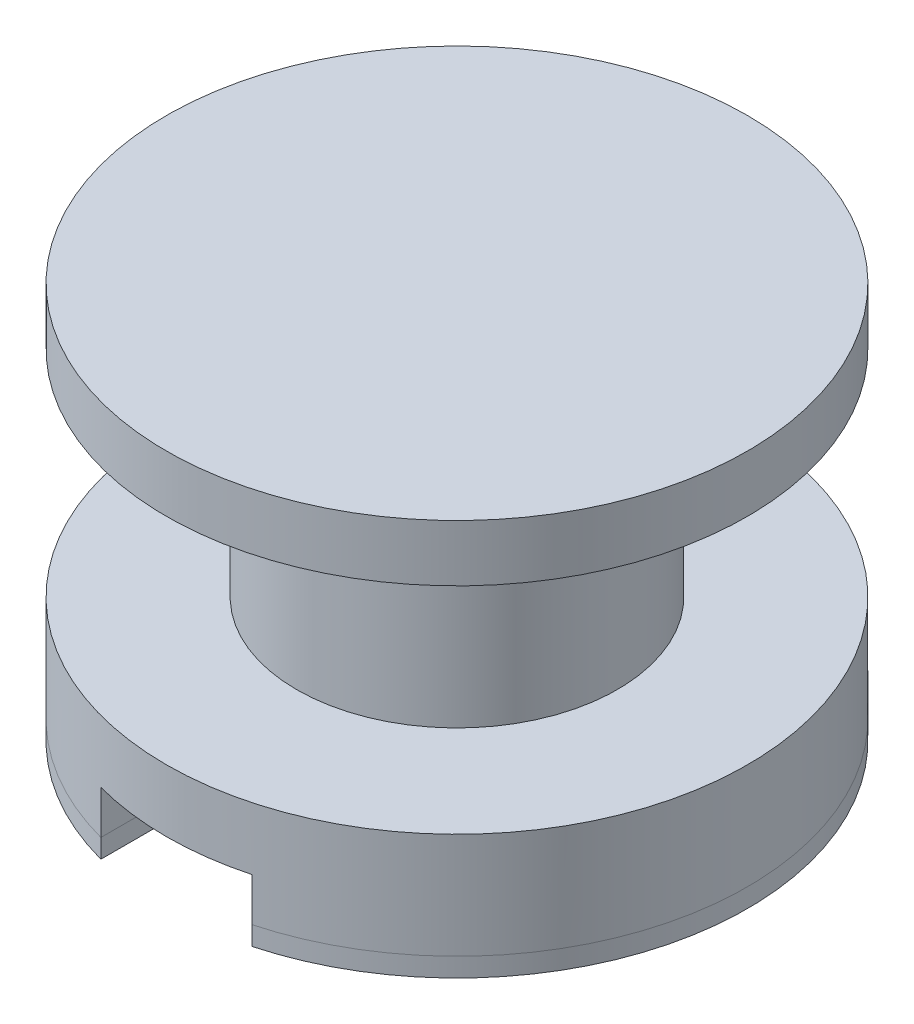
ISO-10303-21;
HEADER;
FILE_DESCRIPTION(('STEP AP214'),'2;1');
FILE_NAME('part.step','',(''),(''),'','','');
FILE_SCHEMA(('AUTOMOTIVE_DESIGN { 1 0 10303 214 1 1 1 1 }'));
ENDSEC;
DATA;
#1=APPLICATION_CONTEXT('core data for automotive mechanical design processes');
#2=APPLICATION_PROTOCOL_DEFINITION('international standard','automotive_design',2000,#1);
#3=PRODUCT_CONTEXT('',#1,'mechanical');
#4=PRODUCT('Part','Part','',(#3));
#5=PRODUCT_RELATED_PRODUCT_CATEGORY('part','',(#4));
#6=PRODUCT_DEFINITION_FORMATION('','',#4);
#7=PRODUCT_DEFINITION_CONTEXT('part definition',#1,'design');
#8=PRODUCT_DEFINITION('design','',#6,#7);
#9=PRODUCT_DEFINITION_SHAPE('','',#8);
#10=(LENGTH_UNIT() NAMED_UNIT(*) SI_UNIT(.MILLI.,.METRE.));
#11=(NAMED_UNIT(*) PLANE_ANGLE_UNIT() SI_UNIT($,.RADIAN.));
#12=(NAMED_UNIT(*) SI_UNIT($,.STERADIAN.) SOLID_ANGLE_UNIT());
#13=UNCERTAINTY_MEASURE_WITH_UNIT(LENGTH_MEASURE(1.E-05),#10,'distance_accuracy_value','');
#14=(GEOMETRIC_REPRESENTATION_CONTEXT(3) GLOBAL_UNCERTAINTY_ASSIGNED_CONTEXT((#13)) GLOBAL_UNIT_ASSIGNED_CONTEXT((#10,
#11,#12)) REPRESENTATION_CONTEXT('',''));
#15=CARTESIAN_POINT('',(0.,0.,0.));
#16=DIRECTION('',(0.,0.,1.));
#17=DIRECTION('',(1.,0.,0.));
#18=AXIS2_PLACEMENT_3D('',#15,#16,#17);
#19=CARTESIAN_POINT('',(0.,0.,0.));
#20=DIRECTION('',(0.,1.,0.));
#21=DIRECTION('',(0.,0.,1.));
#22=AXIS2_PLACEMENT_3D('',#19,#20,#21);
#23=CYLINDRICAL_SURFACE('',#22,3.9116);
#24=CARTESIAN_POINT('',(0.,0.254,0.));
#25=DIRECTION('',(0.,-1.,0.));
#26=DIRECTION('',(0.,0.,-1.));
#27=AXIS2_PLACEMENT_3D('',#24,#25,#26);
#28=CIRCLE('',#27,3.9116);
#29=CARTESIAN_POINT('',(1.016,0.254,-3.77734808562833));
#30=VERTEX_POINT('',#29);
#31=CARTESIAN_POINT('',(1.016,0.254,3.77734808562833));
#32=VERTEX_POINT('',#31);
#33=EDGE_CURVE('E76',#30,#32,#28,.T.);
#34=ORIENTED_EDGE('',*,*,#33,.T.);
#35=DIRECTION('',(0.,1.,0.));
#36=VECTOR('',#35,1.);
#37=CARTESIAN_POINT('',(1.016,0.,3.77734808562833));
#38=LINE('',#37,#36);
#39=CARTESIAN_POINT('',(1.016,0.,3.77734808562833));
#40=VERTEX_POINT('',#39);
#41=EDGE_CURVE('E12',#40,#32,#38,.T.);
#42=ORIENTED_EDGE('',*,*,#41,.F.);
#43=CARTESIAN_POINT('',(0.,0.,0.));
#44=DIRECTION('',(0.,-1.,0.));
#45=DIRECTION('',(0.,0.,-1.));
#46=AXIS2_PLACEMENT_3D('',#43,#44,#45);
#47=CIRCLE('',#46,3.9116);
#48=CARTESIAN_POINT('',(1.016,0.,-3.77734808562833));
#49=VERTEX_POINT('',#48);
#50=EDGE_CURVE('E75',#49,#40,#47,.T.);
#51=ORIENTED_EDGE('',*,*,#50,.F.);
#52=DIRECTION('',(0.,1.,0.));
#53=VECTOR('',#52,1.);
#54=CARTESIAN_POINT('',(1.016,0.,-3.77734808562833));
#55=LINE('',#54,#53);
#56=EDGE_CURVE('E53',#49,#30,#55,.T.);
#57=ORIENTED_EDGE('',*,*,#56,.T.);
#58=EDGE_LOOP('',(#34,#42,#51,#57));
#59=FACE_BOUND('',#58,.T.);
#60=ADVANCED_FACE('F45',(#59),#23,.T.);
#61=CARTESIAN_POINT('',(1.016,0.,3.77734808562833));
#62=DIRECTION('',(1.,0.,0.));
#63=DIRECTION('',(0.,0.,-1.));
#64=AXIS2_PLACEMENT_3D('',#61,#62,#63);
#65=PLANE('',#64);
#66=DIRECTION('',(0.,0.,-1.));
#67=VECTOR('',#66,1.);
#68=CARTESIAN_POINT('',(1.016,0.254,3.77734808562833));
#69=LINE('',#68,#67);
#70=EDGE_CURVE('E68',#32,#30,#69,.T.);
#71=ORIENTED_EDGE('',*,*,#70,.T.);
#72=ORIENTED_EDGE('',*,*,#56,.F.);
#73=DIRECTION('',(0.,0.,-1.));
#74=VECTOR('',#73,1.);
#75=CARTESIAN_POINT('',(1.016,0.,3.77734808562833));
#76=LINE('',#75,#74);
#77=EDGE_CURVE('E60',#40,#49,#76,.T.);
#78=ORIENTED_EDGE('',*,*,#77,.F.);
#79=ORIENTED_EDGE('',*,*,#41,.T.);
#80=EDGE_LOOP('',(#71,#72,#78,#79));
#81=FACE_BOUND('',#80,.T.);
#82=ADVANCED_FACE('F71',(#81),#65,.F.);
#83=CARTESIAN_POINT('',(0.,0.,0.));
#84=DIRECTION('',(0.,-1.,0.));
#85=DIRECTION('',(0.,0.,-1.));
#86=AXIS2_PLACEMENT_3D('',#83,#84,#85);
#87=PLANE('',#86);
#88=ORIENTED_EDGE('',*,*,#50,.T.);
#89=ORIENTED_EDGE('',*,*,#77,.T.);
#90=EDGE_LOOP('',(#88,#89));
#91=FACE_BOUND('',#90,.T.);
#92=ADVANCED_FACE('F83',(#91),#87,.T.);
#93=CARTESIAN_POINT('',(0.,0.254,0.));
#94=DIRECTION('',(0.,-1.,0.));
#95=DIRECTION('',(0.,0.,-1.));
#96=AXIS2_PLACEMENT_3D('',#93,#94,#95);
#97=PLANE('',#96);
#98=ORIENTED_EDGE('',*,*,#33,.F.);
#99=ORIENTED_EDGE('',*,*,#70,.F.);
#100=EDGE_LOOP('',(#98,#99));
#101=FACE_BOUND('',#100,.T.);
#102=ADVANCED_FACE('F79',(#101),#97,.F.);
#103=CLOSED_SHELL('',(#60,#82,#92,#102));
#104=MANIFOLD_SOLID_BREP('B2',#103);
#105=CARTESIAN_POINT('',(0.,0.,0.));
#106=DIRECTION('',(0.,1.,0.));
#107=DIRECTION('',(0.,0.,1.));
#108=AXIS2_PLACEMENT_3D('',#105,#106,#107);
#109=CYLINDRICAL_SURFACE('',#108,3.9116);
#110=CARTESIAN_POINT('',(0.,0.254,0.));
#111=DIRECTION('',(0.,-1.,0.));
#112=DIRECTION('',(0.,0.,-1.));
#113=AXIS2_PLACEMENT_3D('',#110,#111,#112);
#114=CIRCLE('',#113,3.9116);
#115=CARTESIAN_POINT('',(-1.016,0.254,3.77734808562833));
#116=VERTEX_POINT('',#115);
#117=CARTESIAN_POINT('',(-1.016,0.254,-3.77734808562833));
#118=VERTEX_POINT('',#117);
#119=EDGE_CURVE('E156',#116,#118,#114,.T.);
#120=ORIENTED_EDGE('',*,*,#119,.T.);
#121=DIRECTION('',(0.,1.,0.));
#122=VECTOR('',#121,1.);
#123=CARTESIAN_POINT('',(-1.016,0.,-3.77734808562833));
#124=LINE('',#123,#122);
#125=CARTESIAN_POINT('',(-1.016,0.,-3.77734808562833));
#126=VERTEX_POINT('',#125);
#127=EDGE_CURVE('E43',#126,#118,#124,.T.);
#128=ORIENTED_EDGE('',*,*,#127,.F.);
#129=CARTESIAN_POINT('',(0.,0.,0.));
#130=DIRECTION('',(0.,-1.,0.));
#131=DIRECTION('',(0.,0.,-1.));
#132=AXIS2_PLACEMENT_3D('',#129,#130,#131);
#133=CIRCLE('',#132,3.9116);
#134=CARTESIAN_POINT('',(-1.016,0.,3.77734808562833));
#135=VERTEX_POINT('',#134);
#136=EDGE_CURVE('E155',#135,#126,#133,.T.);
#137=ORIENTED_EDGE('',*,*,#136,.F.);
#138=DIRECTION('',(0.,1.,0.));
#139=VECTOR('',#138,1.);
#140=CARTESIAN_POINT('',(-1.016,0.,3.77734808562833));
#141=LINE('',#140,#139);
#142=EDGE_CURVE('E133',#135,#116,#141,.T.);
#143=ORIENTED_EDGE('',*,*,#142,.T.);
#144=EDGE_LOOP('',(#120,#128,#137,#143));
#145=FACE_BOUND('',#144,.T.);
#146=ADVANCED_FACE('F125',(#145),#109,.T.);
#147=CARTESIAN_POINT('',(-1.016,0.,3.77734808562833));
#148=DIRECTION('',(-1.,0.,0.));
#149=DIRECTION('',(0.,0.,1.));
#150=AXIS2_PLACEMENT_3D('',#147,#148,#149);
#151=PLANE('',#150);
#152=DIRECTION('',(0.,0.,1.));
#153=VECTOR('',#152,1.);
#154=CARTESIAN_POINT('',(-1.016,0.254,3.77734808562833));
#155=LINE('',#154,#153);
#156=EDGE_CURVE('E148',#118,#116,#155,.T.);
#157=ORIENTED_EDGE('',*,*,#156,.T.);
#158=ORIENTED_EDGE('',*,*,#142,.F.);
#159=DIRECTION('',(0.,0.,1.));
#160=VECTOR('',#159,1.);
#161=CARTESIAN_POINT('',(-1.016,0.,3.77734808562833));
#162=LINE('',#161,#160);
#163=EDGE_CURVE('E140',#126,#135,#162,.T.);
#164=ORIENTED_EDGE('',*,*,#163,.F.);
#165=ORIENTED_EDGE('',*,*,#127,.T.);
#166=EDGE_LOOP('',(#157,#158,#164,#165));
#167=FACE_BOUND('',#166,.T.);
#168=ADVANCED_FACE('F151',(#167),#151,.F.);
#169=CARTESIAN_POINT('',(0.,0.,0.));
#170=DIRECTION('',(0.,-1.,0.));
#171=DIRECTION('',(0.,0.,-1.));
#172=AXIS2_PLACEMENT_3D('',#169,#170,#171);
#173=PLANE('',#172);
#174=ORIENTED_EDGE('',*,*,#136,.T.);
#175=ORIENTED_EDGE('',*,*,#163,.T.);
#176=EDGE_LOOP('',(#174,#175));
#177=FACE_BOUND('',#176,.T.);
#178=ADVANCED_FACE('F163',(#177),#173,.T.);
#179=CARTESIAN_POINT('',(0.,0.254,0.));
#180=DIRECTION('',(0.,-1.,0.));
#181=DIRECTION('',(0.,0.,-1.));
#182=AXIS2_PLACEMENT_3D('',#179,#180,#181);
#183=PLANE('',#182);
#184=ORIENTED_EDGE('',*,*,#119,.F.);
#185=ORIENTED_EDGE('',*,*,#156,.F.);
#186=EDGE_LOOP('',(#184,#185));
#187=FACE_BOUND('',#186,.T.);
#188=ADVANCED_FACE('F159',(#187),#183,.F.);
#189=CLOSED_SHELL('',(#146,#168,#178,#188));
#190=MANIFOLD_SOLID_BREP('B6',#189);
#191=CARTESIAN_POINT('',(0.,1.6764,0.));
#192=DIRECTION('',(0.,-1.,0.));
#193=DIRECTION('',(0.,0.,-1.));
#194=AXIS2_PLACEMENT_3D('',#191,#192,#193);
#195=CYLINDRICAL_SURFACE('',#194,3.9116);
#196=CARTESIAN_POINT('',(0.,1.6764,0.));
#197=DIRECTION('',(0.,1.,0.));
#198=DIRECTION('',(0.,0.,1.));
#199=AXIS2_PLACEMENT_3D('',#196,#197,#198);
#200=CIRCLE('',#199,3.9116);
#201=CARTESIAN_POINT('',(0.,1.6764,3.9116));
#202=VERTEX_POINT('',#201);
#203=EDGE_CURVE('E252',#202,#202,#200,.T.);
#204=ORIENTED_EDGE('',*,*,#203,.F.);
#205=EDGE_LOOP('',(#204));
#206=FACE_BOUND('',#205,.T.);
#207=CARTESIAN_POINT('',(0.,0.254,0.));
#208=DIRECTION('',(0.,-1.,0.));
#209=DIRECTION('',(0.,0.,-1.));
#210=AXIS2_PLACEMENT_3D('',#207,#208,#209);
#211=CIRCLE('',#210,3.9116);
#212=CARTESIAN_POINT('',(1.016,0.254,-3.77734808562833));
#213=VERTEX_POINT('',#212);
#214=CARTESIAN_POINT('',(1.016,0.254,3.77734808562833));
#215=VERTEX_POINT('',#214);
#216=EDGE_CURVE('E209',#213,#215,#211,.T.);
#217=ORIENTED_EDGE('',*,*,#216,.F.);
#218=DIRECTION('',(0.,-1.,0.));
#219=VECTOR('',#218,1.);
#220=CARTESIAN_POINT('',(1.016,1.6764,-3.77734808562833));
#221=LINE('',#220,#219);
#222=CARTESIAN_POINT('',(1.016,0.8382,-3.77734808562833));
#223=VERTEX_POINT('',#222);
#224=EDGE_CURVE('E242',#213,#223,#221,.F.);
#225=ORIENTED_EDGE('',*,*,#224,.T.);
#226=CARTESIAN_POINT('',(0.,0.8382,0.));
#227=DIRECTION('',(0.,1.,0.));
#228=DIRECTION('',(0.,0.,1.));
#229=AXIS2_PLACEMENT_3D('',#226,#227,#228);
#230=CIRCLE('',#229,3.9116);
#231=CARTESIAN_POINT('',(-1.016,0.8382,-3.77734808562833));
#232=VERTEX_POINT('',#231);
#233=EDGE_CURVE('E261',#223,#232,#230,.T.);
#234=ORIENTED_EDGE('',*,*,#233,.T.);
#235=DIRECTION('',(0.,-1.,0.));
#236=VECTOR('',#235,1.);
#237=CARTESIAN_POINT('',(-1.016,1.6764,-3.77734808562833));
#238=LINE('',#237,#236);
#239=CARTESIAN_POINT('',(-1.016,0.254,-3.77734808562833));
#240=VERTEX_POINT('',#239);
#241=EDGE_CURVE('E250',#232,#240,#238,.T.);
#242=ORIENTED_EDGE('',*,*,#241,.T.);
#243=CARTESIAN_POINT('',(-1.016,0.254,3.77734808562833));
#244=VERTEX_POINT('',#243);
#245=EDGE_CURVE('E215',#244,#240,#211,.T.);
#246=ORIENTED_EDGE('',*,*,#245,.F.);
#247=DIRECTION('',(0.,-1.,0.));
#248=VECTOR('',#247,1.);
#249=CARTESIAN_POINT('',(-1.016,1.6764,3.77734808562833));
#250=LINE('',#249,#248);
#251=CARTESIAN_POINT('',(-1.016,0.8382,3.77734808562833));
#252=VERTEX_POINT('',#251);
#253=EDGE_CURVE('E255',#244,#252,#250,.F.);
#254=ORIENTED_EDGE('',*,*,#253,.T.);
#255=CARTESIAN_POINT('',(1.016,0.8382,3.77734808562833));
#256=VERTEX_POINT('',#255);
#257=EDGE_CURVE('E260',#252,#256,#230,.T.);
#258=ORIENTED_EDGE('',*,*,#257,.T.);
#259=DIRECTION('',(0.,-1.,0.));
#260=VECTOR('',#259,1.);
#261=CARTESIAN_POINT('',(1.016,1.6764,3.77734808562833));
#262=LINE('',#261,#260);
#263=EDGE_CURVE('E244',#256,#215,#262,.T.);
#264=ORIENTED_EDGE('',*,*,#263,.T.);
#265=EDGE_LOOP('',(#217,#225,#234,#242,#246,#254,#258,#264));
#266=FACE_BOUND('',#265,.T.);
#267=ADVANCED_FACE('F196',(#206,#266),#195,.T.);
#268=CARTESIAN_POINT('',(1.016,0.8382,-3.9116));
#269=DIRECTION('',(1.,0.,0.));
#270=DIRECTION('',(0.,0.,-1.));
#271=AXIS2_PLACEMENT_3D('',#268,#269,#270);
#272=PLANE('',#271);
#273=DIRECTION('',(0.,0.,-1.));
#274=VECTOR('',#273,1.);
#275=CARTESIAN_POINT('',(1.016,0.254,-3.9116));
#276=LINE('',#275,#274);
#277=EDGE_CURVE('E232',#215,#213,#276,.T.);
#278=ORIENTED_EDGE('',*,*,#277,.F.);
#279=ORIENTED_EDGE('',*,*,#263,.F.);
#280=DIRECTION('',(0.,0.,1.));
#281=VECTOR('',#280,1.);
#282=CARTESIAN_POINT('',(1.016,0.8382,-3.9116));
#283=LINE('',#282,#281);
#284=EDGE_CURVE('E249',#223,#256,#283,.T.);
#285=ORIENTED_EDGE('',*,*,#284,.F.);
#286=ORIENTED_EDGE('',*,*,#224,.F.);
#287=EDGE_LOOP('',(#278,#279,#285,#286));
#288=FACE_BOUND('',#287,.T.);
#289=ADVANCED_FACE('F247',(#288),#272,.F.);
#290=CARTESIAN_POINT('',(-1.016,0.8382,-3.9116));
#291=DIRECTION('',(-1.,0.,0.));
#292=DIRECTION('',(0.,0.,1.));
#293=AXIS2_PLACEMENT_3D('',#290,#291,#292);
#294=PLANE('',#293);
#295=DIRECTION('',(0.,0.,1.));
#296=VECTOR('',#295,1.);
#297=CARTESIAN_POINT('',(-1.016,0.254,-3.9116));
#298=LINE('',#297,#296);
#299=EDGE_CURVE('E123',#240,#244,#298,.T.);
#300=ORIENTED_EDGE('',*,*,#299,.F.);
#301=ORIENTED_EDGE('',*,*,#241,.F.);
#302=DIRECTION('',(0.,0.,-1.));
#303=VECTOR('',#302,1.);
#304=CARTESIAN_POINT('',(-1.016,0.8382,-3.9116));
#305=LINE('',#304,#303);
#306=EDGE_CURVE('E272',#252,#232,#305,.T.);
#307=ORIENTED_EDGE('',*,*,#306,.F.);
#308=ORIENTED_EDGE('',*,*,#253,.F.);
#309=EDGE_LOOP('',(#300,#301,#307,#308));
#310=FACE_BOUND('',#309,.T.);
#311=ADVANCED_FACE('F279',(#310),#294,.F.);
#312=CARTESIAN_POINT('',(0.,1.6764,0.));
#313=DIRECTION('',(0.,1.,0.));
#314=DIRECTION('',(0.,0.,1.));
#315=AXIS2_PLACEMENT_3D('',#312,#313,#314);
#316=PLANE('',#315);
#317=CARTESIAN_POINT('',(0.,1.6764,0.));
#318=DIRECTION('',(0.,1.,0.));
#319=DIRECTION('',(0.,0.,1.));
#320=AXIS2_PLACEMENT_3D('',#317,#318,#319);
#321=CIRCLE('',#320,2.159);
#322=CARTESIAN_POINT('',(0.,1.6764,2.159));
#323=VERTEX_POINT('',#322);
#324=EDGE_CURVE('E203',#323,#323,#321,.T.);
#325=ORIENTED_EDGE('',*,*,#324,.F.);
#326=EDGE_LOOP('',(#325));
#327=FACE_BOUND('',#326,.T.);
#328=ORIENTED_EDGE('',*,*,#203,.T.);
#329=EDGE_LOOP('',(#328));
#330=FACE_BOUND('',#329,.T.);
#331=ADVANCED_FACE('F300',(#327,#330),#316,.T.);
#332=CARTESIAN_POINT('',(0.,0.8382,0.));
#333=DIRECTION('',(0.,1.,0.));
#334=DIRECTION('',(0.,0.,1.));
#335=AXIS2_PLACEMENT_3D('',#332,#333,#334);
#336=PLANE('',#335);
#337=ORIENTED_EDGE('',*,*,#284,.T.);
#338=ORIENTED_EDGE('',*,*,#257,.F.);
#339=ORIENTED_EDGE('',*,*,#306,.T.);
#340=ORIENTED_EDGE('',*,*,#233,.F.);
#341=EDGE_LOOP('',(#337,#338,#339,#340));
#342=FACE_BOUND('',#341,.T.);
#343=ADVANCED_FACE('F278',(#342),#336,.F.);
#344=CARTESIAN_POINT('',(0.,4.572,0.));
#345=DIRECTION('',(0.,-1.,0.));
#346=DIRECTION('',(0.,0.,-1.));
#347=AXIS2_PLACEMENT_3D('',#344,#345,#346);
#348=CYLINDRICAL_SURFACE('',#347,2.159);
#349=CARTESIAN_POINT('',(0.,4.572,0.));
#350=DIRECTION('',(0.,1.,0.));
#351=DIRECTION('',(0.,0.,1.));
#352=AXIS2_PLACEMENT_3D('',#349,#350,#351);
#353=CIRCLE('',#352,2.159);
#354=CARTESIAN_POINT('',(0.,4.572,2.159));
#355=VERTEX_POINT('',#354);
#356=EDGE_CURVE('E269',#355,#355,#353,.T.);
#357=ORIENTED_EDGE('',*,*,#356,.F.);
#358=EDGE_LOOP('',(#357));
#359=FACE_BOUND('',#358,.T.);
#360=ORIENTED_EDGE('',*,*,#324,.T.);
#361=EDGE_LOOP('',(#360));
#362=FACE_BOUND('',#361,.T.);
#363=ADVANCED_FACE('F307',(#359,#362),#348,.T.);
#364=CARTESIAN_POINT('',(0.,5.334,0.));
#365=DIRECTION('',(0.,-1.,0.));
#366=DIRECTION('',(0.,0.,-1.));
#367=AXIS2_PLACEMENT_3D('',#364,#365,#366);
#368=CYLINDRICAL_SURFACE('',#367,3.9116);
#369=CARTESIAN_POINT('',(0.,5.334,0.));
#370=DIRECTION('',(0.,1.,0.));
#371=DIRECTION('',(0.,0.,1.));
#372=AXIS2_PLACEMENT_3D('',#369,#370,#371);
#373=CIRCLE('',#372,3.9116);
#374=CARTESIAN_POINT('',(0.,5.334,-3.9116));
#375=VERTEX_POINT('',#374);
#376=EDGE_CURVE('E323',#375,#375,#373,.T.);
#377=CARTESIAN_POINT('',(0.,4.572,0.));
#378=DIRECTION('',(0.,1.,0.));
#379=DIRECTION('',(0.,0.,1.));
#380=AXIS2_PLACEMENT_3D('',#377,#378,#379);
#381=CIRCLE('',#380,3.9116);
#382=CARTESIAN_POINT('',(0.,4.572,-3.9116));
#383=VERTEX_POINT('',#382);
#384=EDGE_CURVE('E238',#383,#383,#381,.T.);
#385=CARTESIAN_POINT('',(0.,5.334,-3.9116));
#386=CARTESIAN_POINT('',(0.,5.3260625,-3.9116));
#387=CARTESIAN_POINT('',(0.,5.318125,-3.9116));
#388=CARTESIAN_POINT('',(0.,5.30225,-3.9116));
#389=CARTESIAN_POINT('',(0.,5.2943125,-3.9116));
#390=CARTESIAN_POINT('',(0.,5.2784375,-3.9116));
#391=CARTESIAN_POINT('',(0.,5.2705,-3.9116));
#392=CARTESIAN_POINT('',(0.,5.254625,-3.9116));
#393=CARTESIAN_POINT('',(0.,5.2466875,-3.9116));
#394=CARTESIAN_POINT('',(0.,5.2308125,-3.9116));
#395=CARTESIAN_POINT('',(0.,5.222875,-3.9116));
#396=CARTESIAN_POINT('',(0.,5.207,-3.9116));
#397=CARTESIAN_POINT('',(0.,5.1990625,-3.9116));
#398=CARTESIAN_POINT('',(0.,5.1831875,-3.9116));
#399=CARTESIAN_POINT('',(0.,5.17525,-3.9116));
#400=CARTESIAN_POINT('',(0.,5.159375,-3.9116));
#401=CARTESIAN_POINT('',(0.,5.1514375,-3.9116));
#402=CARTESIAN_POINT('',(0.,5.1355625,-3.9116));
#403=CARTESIAN_POINT('',(0.,5.127625,-3.9116));
#404=CARTESIAN_POINT('',(0.,5.11175,-3.9116));
#405=CARTESIAN_POINT('',(0.,5.1038125,-3.9116));
#406=CARTESIAN_POINT('',(0.,5.0879375,-3.9116));
#407=CARTESIAN_POINT('',(0.,5.08,-3.9116));
#408=CARTESIAN_POINT('',(0.,5.064125,-3.9116));
#409=CARTESIAN_POINT('',(0.,5.0561875,-3.9116));
#410=CARTESIAN_POINT('',(0.,5.0403125,-3.9116));
#411=CARTESIAN_POINT('',(0.,5.032375,-3.9116));
#412=CARTESIAN_POINT('',(0.,5.0165,-3.9116));
#413=CARTESIAN_POINT('',(0.,5.0085625,-3.9116));
#414=CARTESIAN_POINT('',(0.,4.9926875,-3.9116));
#415=CARTESIAN_POINT('',(0.,4.98475,-3.9116));
#416=CARTESIAN_POINT('',(0.,4.968875,-3.9116));
#417=CARTESIAN_POINT('',(0.,4.9609375,-3.9116));
#418=CARTESIAN_POINT('',(0.,4.9450625,-3.9116));
#419=CARTESIAN_POINT('',(0.,4.937125,-3.9116));
#420=CARTESIAN_POINT('',(0.,4.92125,-3.9116));
#421=CARTESIAN_POINT('',(0.,4.9133125,-3.9116));
#422=CARTESIAN_POINT('',(0.,4.8974375,-3.9116));
#423=CARTESIAN_POINT('',(0.,4.8895,-3.9116));
#424=CARTESIAN_POINT('',(0.,4.873625,-3.9116));
#425=CARTESIAN_POINT('',(0.,4.8656875,-3.9116));
#426=CARTESIAN_POINT('',(0.,4.8498125,-3.9116));
#427=CARTESIAN_POINT('',(0.,4.841875,-3.9116));
#428=CARTESIAN_POINT('',(0.,4.826,-3.9116));
#429=CARTESIAN_POINT('',(0.,4.8180625,-3.9116));
#430=CARTESIAN_POINT('',(0.,4.8021875,-3.9116));
#431=CARTESIAN_POINT('',(0.,4.79425,-3.9116));
#432=CARTESIAN_POINT('',(0.,4.778375,-3.9116));
#433=CARTESIAN_POINT('',(0.,4.7704375,-3.9116));
#434=CARTESIAN_POINT('',(0.,4.7545625,-3.9116));
#435=CARTESIAN_POINT('',(0.,4.746625,-3.9116));
#436=CARTESIAN_POINT('',(0.,4.73075,-3.9116));
#437=CARTESIAN_POINT('',(0.,4.7228125,-3.9116));
#438=CARTESIAN_POINT('',(0.,4.7069375,-3.9116));
#439=CARTESIAN_POINT('',(0.,4.699,-3.9116));
#440=CARTESIAN_POINT('',(0.,4.683125,-3.9116));
#441=CARTESIAN_POINT('',(0.,4.6751875,-3.9116));
#442=CARTESIAN_POINT('',(0.,4.6593125,-3.9116));
#443=CARTESIAN_POINT('',(0.,4.651375,-3.9116));
#444=CARTESIAN_POINT('',(0.,4.6355,-3.9116));
#445=CARTESIAN_POINT('',(0.,4.6275625,-3.9116));
#446=CARTESIAN_POINT('',(0.,4.6116875,-3.9116));
#447=CARTESIAN_POINT('',(0.,4.60375,-3.9116));
#448=CARTESIAN_POINT('',(0.,4.587875,-3.9116));
#449=CARTESIAN_POINT('',(0.,4.5799375,-3.9116));
#450=CARTESIAN_POINT('',(0.,4.572,-3.9116));
#451=B_SPLINE_CURVE_WITH_KNOTS('',3,(#385,#386,#387,#388,#389,#390,#391,#392,#393,#394,#395,
#396,#397,#398,#399,#400,#401,#402,#403,#404,#405,#406,#407,#408,#409,#410,#411,#412,#413,#414,
#415,#416,#417,#418,#419,#420,#421,#422,#423,#424,#425,#426,#427,#428,#429,#430,#431,#432,#433,
#434,#435,#436,#437,#438,#439,#440,#441,#442,#443,#444,#445,#446,#447,#448,#449,#450),
.UNSPECIFIED.,.F.,.F.,(4,2,2,2,2,2,2,2,2,2,2,2,2,2,2,2,2,2,2,2,2,2,2,2,2,2,2,2,2,2,2,2,4),(0.,
0.0238125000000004,0.0476250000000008,0.0714375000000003,0.0952500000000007,0.1190625,
0.142875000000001,0.1666875,0.190500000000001,0.2143125,0.238125,0.2619375,0.28575,0.3095625,
0.333375,0.357187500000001,0.381,0.404812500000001,0.428625,0.452437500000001,0.47625,
0.500062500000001,0.523875,0.5476875,0.5715,0.5953125,0.619125,0.6429375,0.66675,0.6905625,
0.714375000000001,0.7381875,0.762000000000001),.UNSPECIFIED.);
#452=EDGE_CURVE('BSEAM313',#375,#383,#451,.T.);
#453=ORIENTED_EDGE('',*,*,#376,.F.);
#454=ORIENTED_EDGE('',*,*,#384,.T.);
#455=ORIENTED_EDGE('',*,*,#452,.T.);
#456=ORIENTED_EDGE('',*,*,#452,.F.);
#457=EDGE_LOOP('',(#453,#455,#454,#456));
#458=FACE_BOUND('',#457,.T.);
#459=ADVANCED_FACE('F313',(#458),#368,.T.);
#460=CARTESIAN_POINT('',(0.,5.334,0.));
#461=DIRECTION('',(0.,1.,0.));
#462=DIRECTION('',(0.,0.,1.));
#463=AXIS2_PLACEMENT_3D('',#460,#461,#462);
#464=PLANE('',#463);
#465=ORIENTED_EDGE('',*,*,#376,.T.);
#466=EDGE_LOOP('',(#465));
#467=FACE_BOUND('',#466,.T.);
#468=ADVANCED_FACE('F288',(#467),#464,.T.);
#469=CARTESIAN_POINT('',(0.,4.572,0.));
#470=DIRECTION('',(0.,1.,0.));
#471=DIRECTION('',(0.,0.,1.));
#472=AXIS2_PLACEMENT_3D('',#469,#470,#471);
#473=PLANE('',#472);
#474=ORIENTED_EDGE('',*,*,#356,.T.);
#475=EDGE_LOOP('',(#474));
#476=FACE_BOUND('',#475,.T.);
#477=ORIENTED_EDGE('',*,*,#384,.F.);
#478=EDGE_LOOP('',(#477));
#479=FACE_BOUND('',#478,.T.);
#480=ADVANCED_FACE('F282',(#476,#479),#473,.F.);
#481=CARTESIAN_POINT('',(0.,0.254,0.));
#482=DIRECTION('',(0.,-1.,0.));
#483=DIRECTION('',(0.,0.,-1.));
#484=AXIS2_PLACEMENT_3D('',#481,#482,#483);
#485=PLANE('',#484);
#486=ORIENTED_EDGE('',*,*,#299,.T.);
#487=ORIENTED_EDGE('',*,*,#245,.T.);
#488=EDGE_LOOP('',(#486,#487));
#489=FACE_BOUND('',#488,.T.);
#490=ADVANCED_FACE('F280',(#489),#485,.T.);
#491=ORIENTED_EDGE('',*,*,#277,.T.);
#492=ORIENTED_EDGE('',*,*,#216,.T.);
#493=EDGE_LOOP('',(#491,#492));
#494=FACE_BOUND('',#493,.T.);
#495=ADVANCED_FACE('F233',(#494),#485,.T.);
#496=CLOSED_SHELL('',(#267,#289,#311,#331,#343,#363,#459,#468,#480,#490,#495));
#497=MANIFOLD_SOLID_BREP('B37',#496);
#498=ADVANCED_BREP_SHAPE_REPRESENTATION('',(#18,#104,#190,#497),#14);
#499=SHAPE_DEFINITION_REPRESENTATION(#9,#498);
ENDSEC;
END-ISO-10303-21;
